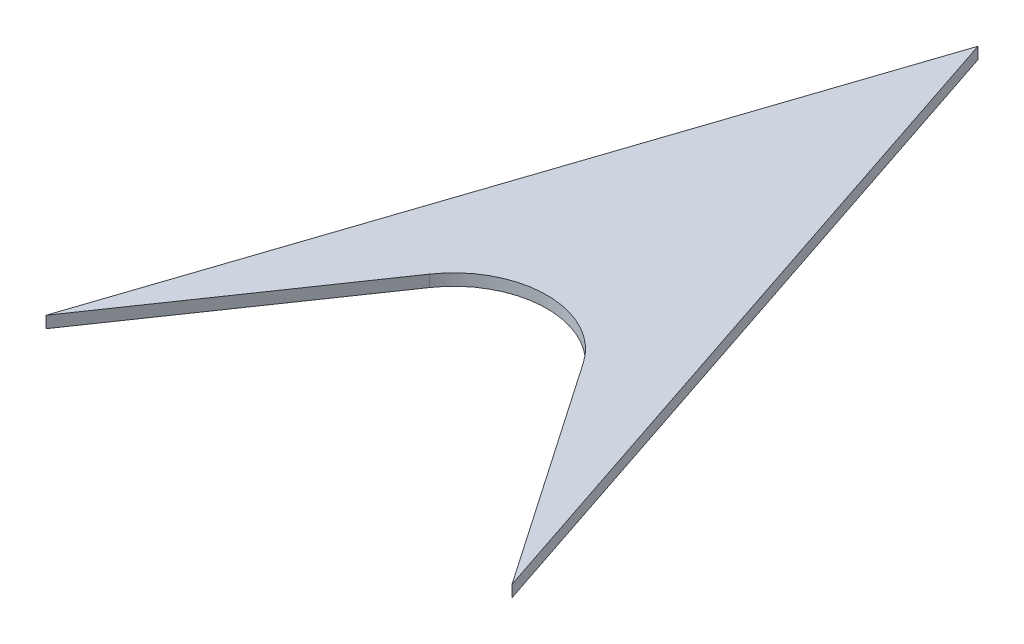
ISO-10303-21;
HEADER;
FILE_DESCRIPTION(('STEP AP214'),'2;1');
FILE_NAME('part.step','',(''),(''),'','','');
FILE_SCHEMA(('AUTOMOTIVE_DESIGN { 1 0 10303 214 1 1 1 1 }'));
ENDSEC;
DATA;
#1=APPLICATION_CONTEXT('core data for automotive mechanical design processes');
#2=APPLICATION_PROTOCOL_DEFINITION('international standard','automotive_design',2000,#1);
#3=PRODUCT_CONTEXT('',#1,'mechanical');
#4=PRODUCT('Part','Part','',(#3));
#5=PRODUCT_RELATED_PRODUCT_CATEGORY('part','',(#4));
#6=PRODUCT_DEFINITION_FORMATION('','',#4);
#7=PRODUCT_DEFINITION_CONTEXT('part definition',#1,'design');
#8=PRODUCT_DEFINITION('design','',#6,#7);
#9=PRODUCT_DEFINITION_SHAPE('','',#8);
#10=(LENGTH_UNIT() NAMED_UNIT(*) SI_UNIT(.MILLI.,.METRE.));
#11=(NAMED_UNIT(*) PLANE_ANGLE_UNIT() SI_UNIT($,.RADIAN.));
#12=(NAMED_UNIT(*) SI_UNIT($,.STERADIAN.) SOLID_ANGLE_UNIT());
#13=UNCERTAINTY_MEASURE_WITH_UNIT(LENGTH_MEASURE(1.E-05),#10,'distance_accuracy_value','');
#14=(GEOMETRIC_REPRESENTATION_CONTEXT(3) GLOBAL_UNCERTAINTY_ASSIGNED_CONTEXT((#13)) GLOBAL_UNIT_ASSIGNED_CONTEXT((#10,
#11,#12)) REPRESENTATION_CONTEXT('',''));
#15=CARTESIAN_POINT('',(0.,0.,0.));
#16=DIRECTION('',(0.,0.,1.));
#17=DIRECTION('',(1.,0.,0.));
#18=AXIS2_PLACEMENT_3D('',#15,#16,#17);
#19=CARTESIAN_POINT('',(20.0000057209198,1.,15.0000039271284));
#20=DIRECTION('',(0.824445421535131,0.,-0.565941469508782));
#21=DIRECTION('',(-0.565941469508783,0.,-0.824445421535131));
#22=AXIS2_PLACEMENT_3D('',#19,#20,#21);
#23=PLANE('',#22);
#24=DIRECTION('',(0.565941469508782,0.,0.824445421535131));
#25=VECTOR('',#24,1.);
#26=CARTESIAN_POINT('',(20.0000057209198,0.,15.0000039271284));
#27=LINE('',#26,#25);
#28=CARTESIAN_POINT('',(6.59538931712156,0.,-4.52741227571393));
#29=VERTEX_POINT('',#28);
#30=CARTESIAN_POINT('',(20.0000057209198,0.,15.0000039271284));
#31=VERTEX_POINT('',#30);
#32=EDGE_CURVE('E80',#29,#31,#27,.T.);
#33=ORIENTED_EDGE('',*,*,#32,.T.);
#34=DIRECTION('',(0.,-1.,0.));
#35=VECTOR('',#34,1.);
#36=CARTESIAN_POINT('',(20.0000057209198,1.,15.0000039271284));
#37=LINE('',#36,#35);
#38=CARTESIAN_POINT('',(20.0000057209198,1.,15.0000039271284));
#39=VERTEX_POINT('',#38);
#40=EDGE_CURVE('E11',#39,#31,#37,.T.);
#41=ORIENTED_EDGE('',*,*,#40,.F.);
#42=DIRECTION('',(0.565941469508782,0.,0.824445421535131));
#43=VECTOR('',#42,1.);
#44=CARTESIAN_POINT('',(20.0000057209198,1.,15.0000039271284));
#45=LINE('',#44,#43);
#46=CARTESIAN_POINT('',(6.59538931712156,1.,-4.52741227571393));
#47=VERTEX_POINT('',#46);
#48=EDGE_CURVE('E101',#47,#39,#45,.T.);
#49=ORIENTED_EDGE('',*,*,#48,.F.);
#50=DIRECTION('',(0.,-1.,0.));
#51=VECTOR('',#50,1.);
#52=CARTESIAN_POINT('',(6.59538931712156,1.,-4.52741227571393));
#53=LINE('',#52,#51);
#54=EDGE_CURVE('E93',#47,#29,#53,.T.);
#55=ORIENTED_EDGE('',*,*,#54,.T.);
#56=EDGE_LOOP('',(#33,#41,#49,#55));
#57=FACE_BOUND('',#56,.T.);
#58=ADVANCED_FACE('F30',(#57),#23,.F.);
#59=CARTESIAN_POINT('',(20.0000057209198,1.,15.0000039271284));
#60=DIRECTION('',(-0.948683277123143,0.,0.316227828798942));
#61=DIRECTION('',(0.316227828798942,0.,0.948683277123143));
#62=AXIS2_PLACEMENT_3D('',#59,#60,#61);
#63=PLANE('',#62);
#64=DIRECTION('',(-0.316227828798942,0.,-0.948683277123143));
#65=VECTOR('',#64,1.);
#66=CARTESIAN_POINT('',(20.0000057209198,0.,15.0000039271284));
#67=LINE('',#66,#65);
#68=CARTESIAN_POINT('',(0.,0.,-45.));
#69=VERTEX_POINT('',#68);
#70=EDGE_CURVE('E76',#31,#69,#67,.T.);
#71=ORIENTED_EDGE('',*,*,#70,.T.);
#72=DIRECTION('',(0.,-1.,0.));
#73=VECTOR('',#72,1.);
#74=CARTESIAN_POINT('',(0.,1.,-45.));
#75=LINE('',#74,#73);
#76=CARTESIAN_POINT('',(0.,1.,-45.));
#77=VERTEX_POINT('',#76);
#78=EDGE_CURVE('E37',#77,#69,#75,.T.);
#79=ORIENTED_EDGE('',*,*,#78,.F.);
#80=DIRECTION('',(-0.316227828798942,0.,-0.948683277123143));
#81=VECTOR('',#80,1.);
#82=CARTESIAN_POINT('',(20.0000057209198,1.,15.0000039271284));
#83=LINE('',#82,#81);
#84=EDGE_CURVE('E89',#39,#77,#83,.T.);
#85=ORIENTED_EDGE('',*,*,#84,.F.);
#86=ORIENTED_EDGE('',*,*,#40,.T.);
#87=EDGE_LOOP('',(#71,#79,#85,#86));
#88=FACE_BOUND('',#87,.T.);
#89=ADVANCED_FACE('F88',(#88),#63,.F.);
#90=CARTESIAN_POINT('',(0.,1.,-45.));
#91=DIRECTION('',(0.948683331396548,0.,0.316227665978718));
#92=DIRECTION('',(0.316227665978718,0.,-0.948683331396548));
#93=AXIS2_PLACEMENT_3D('',#90,#91,#92);
#94=PLANE('',#93);
#95=DIRECTION('',(-0.316227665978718,0.,0.948683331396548));
#96=VECTOR('',#95,1.);
#97=CARTESIAN_POINT('',(0.,0.,-45.));
#98=LINE('',#97,#96);
#99=CARTESIAN_POINT('',(-19.9999942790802,0.,15.0000039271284));
#100=VERTEX_POINT('',#99);
#101=EDGE_CURVE('E82',#69,#100,#98,.T.);
#102=ORIENTED_EDGE('',*,*,#101,.T.);
#103=DIRECTION('',(0.,-1.,0.));
#104=VECTOR('',#103,1.);
#105=CARTESIAN_POINT('',(-19.9999942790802,1.,15.0000039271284));
#106=LINE('',#105,#104);
#107=CARTESIAN_POINT('',(-19.9999942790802,1.,15.0000039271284));
#108=VERTEX_POINT('',#107);
#109=EDGE_CURVE('E112',#108,#100,#106,.T.);
#110=ORIENTED_EDGE('',*,*,#109,.F.);
#111=DIRECTION('',(-0.316227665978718,0.,0.948683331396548));
#112=VECTOR('',#111,1.);
#113=CARTESIAN_POINT('',(0.,1.,-45.));
#114=LINE('',#113,#112);
#115=EDGE_CURVE('E104',#77,#108,#114,.T.);
#116=ORIENTED_EDGE('',*,*,#115,.F.);
#117=ORIENTED_EDGE('',*,*,#78,.T.);
#118=EDGE_LOOP('',(#102,#110,#116,#117));
#119=FACE_BOUND('',#118,.T.);
#120=ADVANCED_FACE('F116',(#119),#94,.F.);
#121=CARTESIAN_POINT('',(-19.9999942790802,1.,15.0000039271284));
#122=DIRECTION('',(-0.82444564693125,0.,-0.565941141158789));
#123=DIRECTION('',(-0.565941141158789,0.,0.82444564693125));
#124=AXIS2_PLACEMENT_3D('',#121,#122,#123);
#125=PLANE('',#124);
#126=DIRECTION('',(0.565941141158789,0.,-0.82444564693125));
#127=VECTOR('',#126,1.);
#128=CARTESIAN_POINT('',(-19.9999942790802,0.,15.0000039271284));
#129=LINE('',#128,#127);
#130=CARTESIAN_POINT('',(-6.59539112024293,0.,-4.52740964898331));
#131=VERTEX_POINT('',#130);
#132=EDGE_CURVE('E97',#100,#131,#129,.T.);
#133=ORIENTED_EDGE('',*,*,#132,.T.);
#134=DIRECTION('',(0.,-1.,0.));
#135=VECTOR('',#134,1.);
#136=CARTESIAN_POINT('',(-6.59539112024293,1.,-4.52740964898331));
#137=LINE('',#136,#135);
#138=CARTESIAN_POINT('',(-6.59539112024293,1.,-4.52740964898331));
#139=VERTEX_POINT('',#138);
#140=EDGE_CURVE('E109',#139,#131,#137,.T.);
#141=ORIENTED_EDGE('',*,*,#140,.F.);
#142=DIRECTION('',(0.565941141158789,0.,-0.82444564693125));
#143=VECTOR('',#142,1.);
#144=CARTESIAN_POINT('',(-19.9999942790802,1.,15.0000039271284));
#145=LINE('',#144,#143);
#146=EDGE_CURVE('E49',#108,#139,#145,.T.);
#147=ORIENTED_EDGE('',*,*,#146,.F.);
#148=ORIENTED_EDGE('',*,*,#109,.T.);
#149=EDGE_LOOP('',(#133,#141,#147,#148));
#150=FACE_BOUND('',#149,.T.);
#151=ADVANCED_FACE('F127',(#150),#125,.F.);
#152=CARTESIAN_POINT('',(0.,1.,0.));
#153=DIRECTION('',(0.,-1.,0.));
#154=DIRECTION('',(0.,0.,-1.));
#155=AXIS2_PLACEMENT_3D('',#152,#153,#154);
#156=CYLINDRICAL_SURFACE('',#155,7.99978888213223);
#157=CARTESIAN_POINT('',(0.,0.,0.));
#158=DIRECTION('',(0.,-1.,0.));
#159=DIRECTION('',(0.,0.,1.));
#160=AXIS2_PLACEMENT_3D('',#157,#158,#159);
#161=CIRCLE('',#160,7.99978888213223);
#162=EDGE_CURVE('E99',#131,#29,#161,.T.);
#163=ORIENTED_EDGE('',*,*,#162,.T.);
#164=ORIENTED_EDGE('',*,*,#54,.F.);
#165=CARTESIAN_POINT('',(0.,1.,0.));
#166=DIRECTION('',(0.,-1.,0.));
#167=DIRECTION('',(0.,0.,1.));
#168=AXIS2_PLACEMENT_3D('',#165,#166,#167);
#169=CIRCLE('',#168,7.99978888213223);
#170=EDGE_CURVE('E44',#139,#47,#169,.T.);
#171=ORIENTED_EDGE('',*,*,#170,.F.);
#172=ORIENTED_EDGE('',*,*,#140,.T.);
#173=EDGE_LOOP('',(#163,#164,#171,#172));
#174=FACE_BOUND('',#173,.T.);
#175=ADVANCED_FACE('F120',(#174),#156,.F.);
#176=CARTESIAN_POINT('',(0.,1.,0.));
#177=DIRECTION('',(0.,1.,0.));
#178=DIRECTION('',(0.,0.,1.));
#179=AXIS2_PLACEMENT_3D('',#176,#177,#178);
#180=PLANE('',#179);
#181=ORIENTED_EDGE('',*,*,#48,.T.);
#182=ORIENTED_EDGE('',*,*,#84,.T.);
#183=ORIENTED_EDGE('',*,*,#115,.T.);
#184=ORIENTED_EDGE('',*,*,#146,.T.);
#185=ORIENTED_EDGE('',*,*,#170,.T.);
#186=EDGE_LOOP('',(#181,#182,#183,#184,#185));
#187=FACE_BOUND('',#186,.T.);
#188=ADVANCED_FACE('F118',(#187),#180,.T.);
#189=CARTESIAN_POINT('',(0.,0.,0.));
#190=DIRECTION('',(0.,1.,0.));
#191=DIRECTION('',(0.,0.,1.));
#192=AXIS2_PLACEMENT_3D('',#189,#190,#191);
#193=PLANE('',#192);
#194=ORIENTED_EDGE('',*,*,#32,.F.);
#195=ORIENTED_EDGE('',*,*,#162,.F.);
#196=ORIENTED_EDGE('',*,*,#132,.F.);
#197=ORIENTED_EDGE('',*,*,#101,.F.);
#198=ORIENTED_EDGE('',*,*,#70,.F.);
#199=EDGE_LOOP('',(#194,#195,#196,#197,#198));
#200=FACE_BOUND('',#199,.T.);
#201=ADVANCED_FACE('F77',(#200),#193,.F.);
#202=CLOSED_SHELL('',(#58,#89,#120,#151,#175,#188,#201));
#203=MANIFOLD_SOLID_BREP('B2',#202);
#204=ADVANCED_BREP_SHAPE_REPRESENTATION('',(#18,#203),#14);
#205=SHAPE_DEFINITION_REPRESENTATION(#9,#204);
ENDSEC;
END-ISO-10303-21;
